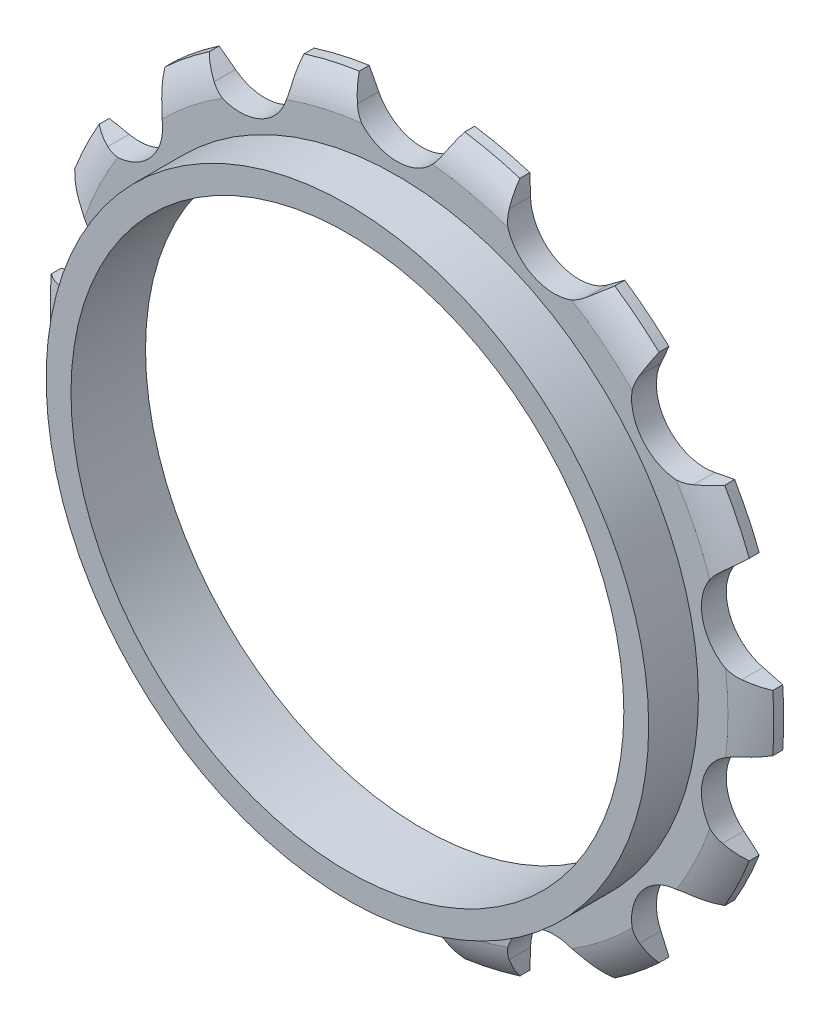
from build123d import *

# Parameters (mm, degrees)
EXTRUDE1_DEPTH      = 42.206446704
CIRPATTERN1_COUNT   = 14
SKETCH4_R           = 24.25
SKETCH4_R_2         = 22.25
EXTRUDE_THIN1_DEPTH = 4


with BuildPart() as part:
    # Sketch2 → Revolve1 (revolve)
    with BuildSketch(Plane(origin=(0, 0, 0), x_dir=(0, 0, -1), z_dir=(1, 0, 0)), mode=Mode.PRIVATE) as revolve1_sk:
        with BuildLine():
            Line((-1.2, 22.25), (0.8, 22.25))
            Line((0.8, 22.25), (0.8, 29.125))
            Line((0.8, 29.125), (0, 29.125))
            ThreePointArc((0, 29.125), (-0.760147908, 27.951870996), (-1.2, 26.625))
            Line((-1.2, 26.625), (-1.2, 22.25))
        make_face()
    revolve(revolve1_sk.sketch.rotate(Axis((0, 0, -80.9), (0, 0, 1)), 90), axis=Axis((0, 0, -80.9), (0, 0, 1)))

    # Sketch1 → Extrude1 (cut, symmetric)
    with BuildSketch(Plane.XY):
        with BuildLine():
            ThreePointArc((-5.782452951, 31.447795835), (-4.585077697, 29.434417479), (-3.481792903, 27.367980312))
            ThreePointArc((-3.481792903, 27.367980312), (0, 25.225), (3.481792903, 27.367980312))
            ThreePointArc((3.481792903, 27.367980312), (4.585077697, 29.434417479), (5.782452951, 31.447795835))
            ThreePointArc((5.782452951, 31.447795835), (0, 31.975), (-5.782452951, 31.447795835))
        make_face()
    extrude1 = extrude(amount=EXTRUDE1_DEPTH, both=True, mode=Mode.SUBTRACT)

    # CirPattern1: Extrude1 ×14 about axis
    cirpattern1_axis = Axis((0, 0, 0), (0, 0, 1))
    for i in range(1, CIRPATTERN1_COUNT):
        add(extrude1.rotate(cirpattern1_axis, i * 360 / CIRPATTERN1_COUNT), mode=Mode.SUBTRACT)

    # Sketch4 → Extrude-Thin1 (add)
    with BuildSketch(Plane.XY.offset(1.2)):
        Circle(SKETCH4_R)
        Circle(SKETCH4_R_2, mode=Mode.SUBTRACT)
    extrude(amount=EXTRUDE_THIN1_DEPTH)


solid = part.part
